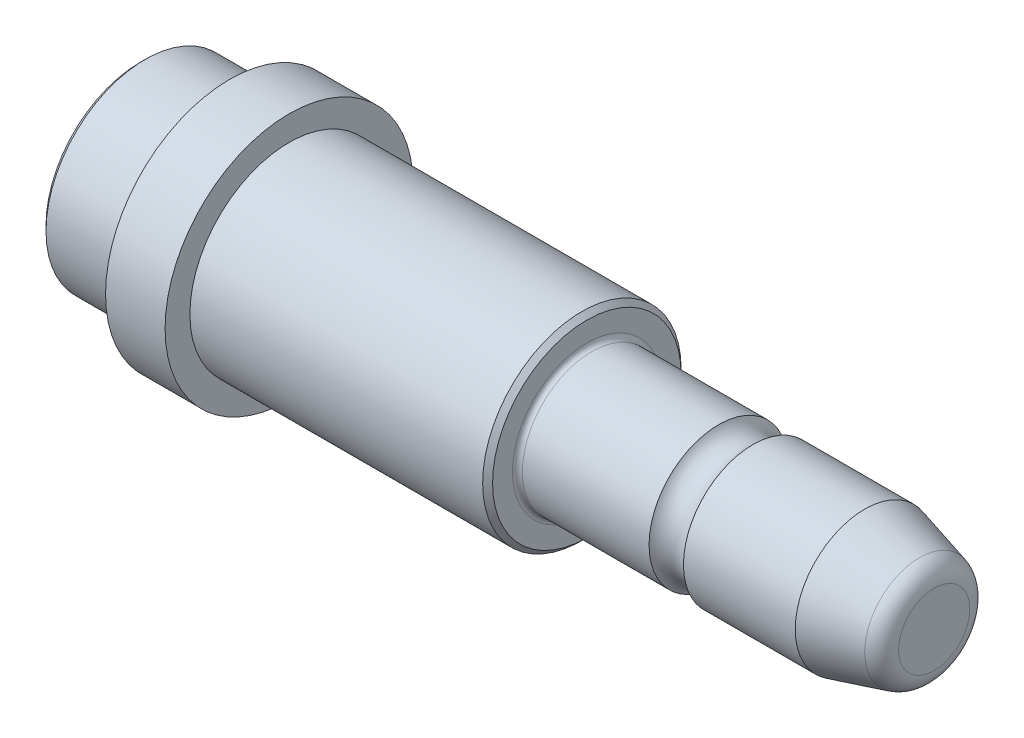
ISO-10303-21;
HEADER;
FILE_DESCRIPTION(('STEP AP214'),'2;1');
FILE_NAME('part.step','',(''),(''),'','','');
FILE_SCHEMA(('AUTOMOTIVE_DESIGN { 1 0 10303 214 1 1 1 1 }'));
ENDSEC;
DATA;
#1=APPLICATION_CONTEXT('core data for automotive mechanical design processes');
#2=APPLICATION_PROTOCOL_DEFINITION('international standard','automotive_design',2000,#1);
#3=PRODUCT_CONTEXT('',#1,'mechanical');
#4=PRODUCT('Part','Part','',(#3));
#5=PRODUCT_RELATED_PRODUCT_CATEGORY('part','',(#4));
#6=PRODUCT_DEFINITION_FORMATION('','',#4);
#7=PRODUCT_DEFINITION_CONTEXT('part definition',#1,'design');
#8=PRODUCT_DEFINITION('design','',#6,#7);
#9=PRODUCT_DEFINITION_SHAPE('','',#8);
#10=(LENGTH_UNIT() NAMED_UNIT(*) SI_UNIT(.MILLI.,.METRE.));
#11=(NAMED_UNIT(*) PLANE_ANGLE_UNIT() SI_UNIT($,.RADIAN.));
#12=(NAMED_UNIT(*) SI_UNIT($,.STERADIAN.) SOLID_ANGLE_UNIT());
#13=UNCERTAINTY_MEASURE_WITH_UNIT(LENGTH_MEASURE(1.E-05),#10,'distance_accuracy_value','');
#14=(GEOMETRIC_REPRESENTATION_CONTEXT(3) GLOBAL_UNCERTAINTY_ASSIGNED_CONTEXT((#13)) GLOBAL_UNIT_ASSIGNED_CONTEXT((#10,
#11,#12)) REPRESENTATION_CONTEXT('',''));
#15=CARTESIAN_POINT('',(0.,0.,0.));
#16=DIRECTION('',(0.,0.,1.));
#17=DIRECTION('',(1.,0.,0.));
#18=AXIS2_PLACEMENT_3D('',#15,#16,#17);
#19=CARTESIAN_POINT('',(9.,12.5,0.));
#20=DIRECTION('',(1.,0.,0.));
#21=DIRECTION('',(0.,0.,-1.));
#22=AXIS2_PLACEMENT_3D('',#19,#20,#21);
#23=PLANE('',#22);
#24=CARTESIAN_POINT('',(9.,0.,0.));
#25=DIRECTION('',(-1.,0.,0.));
#26=DIRECTION('',(0.,0.,1.));
#27=AXIS2_PLACEMENT_3D('',#24,#25,#26);
#28=CIRCLE('',#27,10.);
#29=CARTESIAN_POINT('',(9.,0.,10.));
#30=VERTEX_POINT('',#29);
#31=EDGE_CURVE('E61',#30,#30,#28,.T.);
#32=ORIENTED_EDGE('',*,*,#31,.F.);
#33=EDGE_LOOP('',(#32));
#34=FACE_BOUND('',#33,.T.);
#35=CARTESIAN_POINT('',(9.,0.,0.));
#36=DIRECTION('',(-1.,0.,0.));
#37=DIRECTION('',(0.,0.,1.));
#38=AXIS2_PLACEMENT_3D('',#35,#36,#37);
#39=CIRCLE('',#38,12.5);
#40=CARTESIAN_POINT('',(9.,0.,12.5));
#41=VERTEX_POINT('',#40);
#42=EDGE_CURVE('E79',#41,#41,#39,.T.);
#43=ORIENTED_EDGE('',*,*,#42,.T.);
#44=EDGE_LOOP('',(#43));
#45=FACE_BOUND('',#44,.T.);
#46=ADVANCED_FACE('F30',(#34,#45),#23,.F.);
#47=CARTESIAN_POINT('',(-12.992566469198,0.,0.));
#48=DIRECTION('',(-1.,0.,0.));
#49=DIRECTION('',(0.,0.,1.));
#50=AXIS2_PLACEMENT_3D('',#47,#48,#49);
#51=CYLINDRICAL_SURFACE('',#50,10.);
#52=CARTESIAN_POINT('',(0.500000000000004,0.,0.));
#53=DIRECTION('',(1.,0.,0.));
#54=DIRECTION('',(0.,0.,-1.));
#55=AXIS2_PLACEMENT_3D('',#52,#53,#54);
#56=CIRCLE('',#55,10.);
#57=CARTESIAN_POINT('',(0.500000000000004,0.,-10.));
#58=VERTEX_POINT('',#57);
#59=EDGE_CURVE('E49',#58,#58,#56,.T.);
#60=ORIENTED_EDGE('',*,*,#59,.T.);
#61=EDGE_LOOP('',(#60));
#62=FACE_BOUND('',#61,.T.);
#63=ORIENTED_EDGE('',*,*,#31,.T.);
#64=EDGE_LOOP('',(#63));
#65=FACE_BOUND('',#64,.T.);
#66=ADVANCED_FACE('F109',(#62,#65),#51,.T.);
#67=CARTESIAN_POINT('',(0.,10.,0.));
#68=DIRECTION('',(1.,0.,0.));
#69=DIRECTION('',(0.,0.,-1.));
#70=AXIS2_PLACEMENT_3D('',#67,#68,#69);
#71=PLANE('',#70);
#72=CARTESIAN_POINT('',(0.,0.,0.));
#73=DIRECTION('',(1.,0.,0.));
#74=DIRECTION('',(0.,0.,-1.));
#75=AXIS2_PLACEMENT_3D('',#72,#73,#74);
#76=CIRCLE('',#75,9.5);
#77=CARTESIAN_POINT('',(0.,0.,-9.5));
#78=VERTEX_POINT('',#77);
#79=EDGE_CURVE('E52',#78,#78,#76,.F.);
#80=ORIENTED_EDGE('',*,*,#79,.T.);
#81=EDGE_LOOP('',(#80));
#82=FACE_BOUND('',#81,.T.);
#83=ADVANCED_FACE('F114',(#82),#71,.F.);
#84=CARTESIAN_POINT('',(80.,5.12435565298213,0.));
#85=DIRECTION('',(-1.,0.,0.));
#86=DIRECTION('',(0.,0.,1.));
#87=AXIS2_PLACEMENT_3D('',#84,#85,#86);
#88=PLANE('',#87);
#89=CARTESIAN_POINT('',(80.,0.,0.));
#90=DIRECTION('',(-1.,0.,0.));
#91=DIRECTION('',(0.,0.,1.));
#92=AXIS2_PLACEMENT_3D('',#89,#90,#91);
#93=CIRCLE('',#92,3.58970167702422);
#94=CARTESIAN_POINT('',(80.,0.,3.58970167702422));
#95=VERTEX_POINT('',#94);
#96=EDGE_CURVE('E10',#95,#95,#93,.F.);
#97=ORIENTED_EDGE('',*,*,#96,.T.);
#98=EDGE_LOOP('',(#97));
#99=FACE_BOUND('',#98,.T.);
#100=ADVANCED_FACE('F121',(#99),#88,.F.);
#101=CARTESIAN_POINT('',(80.,0.,0.));
#102=DIRECTION('',(-1.,0.,0.));
#103=DIRECTION('',(0.,0.,1.));
#104=AXIS2_PLACEMENT_3D('',#101,#102,#103);
#105=CONICAL_SURFACE('',#104,5.12435565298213,0.26179938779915);
#106=CARTESIAN_POINT('',(78.517638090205,0.,0.));
#107=DIRECTION('',(1.,0.,0.));
#108=DIRECTION('',(0.,0.,-1.));
#109=AXIS2_PLACEMENT_3D('',#106,#107,#108);
#110=CIRCLE('',#109,5.52155332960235);
#111=CARTESIAN_POINT('',(78.517638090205,0.,-5.52155332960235));
#112=VERTEX_POINT('',#111);
#113=EDGE_CURVE('E36',#112,#112,#110,.F.);
#114=ORIENTED_EDGE('',*,*,#113,.T.);
#115=EDGE_LOOP('',(#114));
#116=FACE_BOUND('',#115,.T.);
#117=CARTESIAN_POINT('',(73.,0.,0.));
#118=DIRECTION('',(-1.,0.,0.));
#119=DIRECTION('',(0.,0.,1.));
#120=AXIS2_PLACEMENT_3D('',#117,#118,#119);
#121=CIRCLE('',#120,7.);
#122=CARTESIAN_POINT('',(73.,0.,7.));
#123=VERTEX_POINT('',#122);
#124=EDGE_CURVE('E64',#123,#123,#121,.T.);
#125=ORIENTED_EDGE('',*,*,#124,.F.);
#126=EDGE_LOOP('',(#125));
#127=FACE_BOUND('',#126,.T.);
#128=ADVANCED_FACE('F127',(#116,#127),#105,.T.);
#129=CARTESIAN_POINT('',(-12.992566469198,0.,0.));
#130=DIRECTION('',(-1.,0.,0.));
#131=DIRECTION('',(0.,0.,1.));
#132=AXIS2_PLACEMENT_3D('',#129,#130,#131);
#133=CYLINDRICAL_SURFACE('',#132,7.);
#134=CARTESIAN_POINT('',(61.7320508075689,0.,0.));
#135=DIRECTION('',(-1.,0.,0.));
#136=DIRECTION('',(0.,0.,1.));
#137=AXIS2_PLACEMENT_3D('',#134,#135,#136);
#138=CIRCLE('',#137,7.);
#139=CARTESIAN_POINT('',(61.7320508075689,0.,7.));
#140=VERTEX_POINT('',#139);
#141=EDGE_CURVE('E67',#140,#140,#138,.T.);
#142=ORIENTED_EDGE('',*,*,#141,.F.);
#143=EDGE_LOOP('',(#142));
#144=FACE_BOUND('',#143,.T.);
#145=ORIENTED_EDGE('',*,*,#124,.T.);
#146=EDGE_LOOP('',(#145));
#147=FACE_BOUND('',#146,.T.);
#148=ADVANCED_FACE('F130',(#144,#147),#133,.T.);
#149=CARTESIAN_POINT('',(60.,0.,0.));
#150=DIRECTION('',(-1.,0.,0.));
#151=DIRECTION('',(0.,0.,1.));
#152=AXIS2_PLACEMENT_3D('',#149,#150,#151);
#153=TOROIDAL_SURFACE('',#152,8.,2.);
#154=CARTESIAN_POINT('',(58.2679491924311,0.,0.));
#155=DIRECTION('',(-1.,0.,0.));
#156=DIRECTION('',(0.,0.,1.));
#157=AXIS2_PLACEMENT_3D('',#154,#155,#156);
#158=CIRCLE('',#157,7.);
#159=CARTESIAN_POINT('',(58.2679491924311,0.,7.));
#160=VERTEX_POINT('',#159);
#161=EDGE_CURVE('E70',#160,#160,#158,.T.);
#162=ORIENTED_EDGE('',*,*,#161,.F.);
#163=EDGE_LOOP('',(#162));
#164=FACE_BOUND('',#163,.T.);
#165=ORIENTED_EDGE('',*,*,#141,.T.);
#166=EDGE_LOOP('',(#165));
#167=FACE_BOUND('',#166,.T.);
#168=ADVANCED_FACE('F133',(#164,#167),#153,.F.);
#169=CARTESIAN_POINT('',(-12.992566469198,0.,0.));
#170=DIRECTION('',(-1.,0.,0.));
#171=DIRECTION('',(0.,0.,1.));
#172=AXIS2_PLACEMENT_3D('',#169,#170,#171);
#173=CYLINDRICAL_SURFACE('',#172,7.);
#174=CARTESIAN_POINT('',(45.5,0.,0.));
#175=DIRECTION('',(-1.,0.,0.));
#176=DIRECTION('',(0.,0.,1.));
#177=AXIS2_PLACEMENT_3D('',#174,#175,#176);
#178=CIRCLE('',#177,7.);
#179=CARTESIAN_POINT('',(45.5,0.,7.));
#180=VERTEX_POINT('',#179);
#181=EDGE_CURVE('E40',#180,#180,#178,.F.);
#182=ORIENTED_EDGE('',*,*,#181,.T.);
#183=EDGE_LOOP('',(#182));
#184=FACE_BOUND('',#183,.T.);
#185=ORIENTED_EDGE('',*,*,#161,.T.);
#186=EDGE_LOOP('',(#185));
#187=FACE_BOUND('',#186,.T.);
#188=ADVANCED_FACE('F105',(#184,#187),#173,.T.);
#189=CARTESIAN_POINT('',(45.,10.,0.));
#190=DIRECTION('',(-1.,0.,0.));
#191=DIRECTION('',(0.,0.,1.));
#192=AXIS2_PLACEMENT_3D('',#189,#190,#191);
#193=PLANE('',#192);
#194=CARTESIAN_POINT('',(45.,0.,0.));
#195=DIRECTION('',(-1.,0.,0.));
#196=DIRECTION('',(0.,0.,1.));
#197=AXIS2_PLACEMENT_3D('',#194,#195,#196);
#198=CIRCLE('',#197,7.5);
#199=CARTESIAN_POINT('',(45.,0.,7.5));
#200=VERTEX_POINT('',#199);
#201=EDGE_CURVE('E44',#200,#200,#198,.T.);
#202=ORIENTED_EDGE('',*,*,#201,.T.);
#203=EDGE_LOOP('',(#202));
#204=FACE_BOUND('',#203,.T.);
#205=CARTESIAN_POINT('',(45.,0.,0.));
#206=DIRECTION('',(-1.,0.,0.));
#207=DIRECTION('',(0.,0.,1.));
#208=AXIS2_PLACEMENT_3D('',#205,#206,#207);
#209=CIRCLE('',#208,9.49999999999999);
#210=CARTESIAN_POINT('',(45.,0.,9.49999999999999));
#211=VERTEX_POINT('',#210);
#212=EDGE_CURVE('E55',#211,#211,#209,.F.);
#213=ORIENTED_EDGE('',*,*,#212,.T.);
#214=EDGE_LOOP('',(#213));
#215=FACE_BOUND('',#214,.T.);
#216=ADVANCED_FACE('F99',(#204,#215),#193,.F.);
#217=CARTESIAN_POINT('',(-12.992566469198,0.,0.));
#218=DIRECTION('',(-1.,0.,0.));
#219=DIRECTION('',(0.,0.,1.));
#220=AXIS2_PLACEMENT_3D('',#217,#218,#219);
#221=CYLINDRICAL_SURFACE('',#220,10.);
#222=CARTESIAN_POINT('',(44.5,0.,0.));
#223=DIRECTION('',(-1.,0.,0.));
#224=DIRECTION('',(0.,0.,1.));
#225=AXIS2_PLACEMENT_3D('',#222,#223,#224);
#226=CIRCLE('',#225,10.);
#227=CARTESIAN_POINT('',(44.5,0.,10.));
#228=VERTEX_POINT('',#227);
#229=EDGE_CURVE('E58',#228,#228,#226,.T.);
#230=ORIENTED_EDGE('',*,*,#229,.T.);
#231=EDGE_LOOP('',(#230));
#232=FACE_BOUND('',#231,.T.);
#233=CARTESIAN_POINT('',(15.,0.,0.));
#234=DIRECTION('',(-1.,0.,0.));
#235=DIRECTION('',(0.,0.,1.));
#236=AXIS2_PLACEMENT_3D('',#233,#234,#235);
#237=CIRCLE('',#236,10.);
#238=CARTESIAN_POINT('',(15.,0.,10.));
#239=VERTEX_POINT('',#238);
#240=EDGE_CURVE('E73',#239,#239,#237,.T.);
#241=ORIENTED_EDGE('',*,*,#240,.F.);
#242=EDGE_LOOP('',(#241));
#243=FACE_BOUND('',#242,.T.);
#244=ADVANCED_FACE('F94',(#232,#243),#221,.T.);
#245=CARTESIAN_POINT('',(15.,12.5,0.));
#246=DIRECTION('',(-1.,0.,0.));
#247=DIRECTION('',(0.,0.,1.));
#248=AXIS2_PLACEMENT_3D('',#245,#246,#247);
#249=PLANE('',#248);
#250=CARTESIAN_POINT('',(15.,0.,0.));
#251=DIRECTION('',(-1.,0.,0.));
#252=DIRECTION('',(0.,0.,1.));
#253=AXIS2_PLACEMENT_3D('',#250,#251,#252);
#254=CIRCLE('',#253,12.5);
#255=CARTESIAN_POINT('',(15.,0.,12.5));
#256=VERTEX_POINT('',#255);
#257=EDGE_CURVE('E76',#256,#256,#254,.T.);
#258=ORIENTED_EDGE('',*,*,#257,.F.);
#259=EDGE_LOOP('',(#258));
#260=FACE_BOUND('',#259,.T.);
#261=ORIENTED_EDGE('',*,*,#240,.T.);
#262=EDGE_LOOP('',(#261));
#263=FACE_BOUND('',#262,.T.);
#264=ADVANCED_FACE('F88',(#260,#263),#249,.F.);
#265=CARTESIAN_POINT('',(-12.992566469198,0.,0.));
#266=DIRECTION('',(-1.,0.,0.));
#267=DIRECTION('',(0.,0.,1.));
#268=AXIS2_PLACEMENT_3D('',#265,#266,#267);
#269=CYLINDRICAL_SURFACE('',#268,12.5);
#270=ORIENTED_EDGE('',*,*,#42,.F.);
#271=EDGE_LOOP('',(#270));
#272=FACE_BOUND('',#271,.T.);
#273=ORIENTED_EDGE('',*,*,#257,.T.);
#274=EDGE_LOOP('',(#273));
#275=FACE_BOUND('',#274,.T.);
#276=ADVANCED_FACE('F84',(#272,#275),#269,.T.);
#277=CARTESIAN_POINT('',(44.5,0.,0.));
#278=DIRECTION('',(-1.,0.,0.));
#279=DIRECTION('',(0.,0.,1.));
#280=AXIS2_PLACEMENT_3D('',#277,#278,#279);
#281=CONICAL_SURFACE('',#280,10.,0.785398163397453);
#282=ORIENTED_EDGE('',*,*,#212,.F.);
#283=EDGE_LOOP('',(#282));
#284=FACE_BOUND('',#283,.T.);
#285=ORIENTED_EDGE('',*,*,#229,.F.);
#286=EDGE_LOOP('',(#285));
#287=FACE_BOUND('',#286,.T.);
#288=ADVANCED_FACE('F87',(#284,#287),#281,.T.);
#289=CARTESIAN_POINT('',(0.,0.,0.));
#290=DIRECTION('',(1.,0.,0.));
#291=DIRECTION('',(0.,0.,-1.));
#292=AXIS2_PLACEMENT_3D('',#289,#290,#291);
#293=CONICAL_SURFACE('',#292,9.5,0.785398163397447);
#294=ORIENTED_EDGE('',*,*,#59,.F.);
#295=EDGE_LOOP('',(#294));
#296=FACE_BOUND('',#295,.T.);
#297=ORIENTED_EDGE('',*,*,#79,.F.);
#298=EDGE_LOOP('',(#297));
#299=FACE_BOUND('',#298,.T.);
#300=ADVANCED_FACE('F155',(#296,#299),#293,.T.);
#301=CARTESIAN_POINT('',(45.5,0.,0.));
#302=DIRECTION('',(-1.,0.,0.));
#303=DIRECTION('',(0.,0.,1.));
#304=AXIS2_PLACEMENT_3D('',#301,#302,#303);
#305=TOROIDAL_SURFACE('',#304,7.5,0.5);
#306=ORIENTED_EDGE('',*,*,#181,.F.);
#307=EDGE_LOOP('',(#306));
#308=FACE_BOUND('',#307,.T.);
#309=ORIENTED_EDGE('',*,*,#201,.F.);
#310=EDGE_LOOP('',(#309));
#311=FACE_BOUND('',#310,.T.);
#312=ADVANCED_FACE('F151',(#308,#311),#305,.F.);
#313=CARTESIAN_POINT('',(78.,0.,0.));
#314=DIRECTION('',(-1.,0.,0.));
#315=DIRECTION('',(0.,0.,1.));
#316=AXIS2_PLACEMENT_3D('',#313,#314,#315);
#317=TOROIDAL_SURFACE('',#316,3.58970167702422,2.);
#318=ORIENTED_EDGE('',*,*,#96,.F.);
#319=EDGE_LOOP('',(#318));
#320=FACE_BOUND('',#319,.T.);
#321=ORIENTED_EDGE('',*,*,#113,.F.);
#322=EDGE_LOOP('',(#321));
#323=FACE_BOUND('',#322,.T.);
#324=ADVANCED_FACE('F154',(#320,#323),#317,.T.);
#325=CLOSED_SHELL('',(#46,#66,#83,#100,#128,#148,#168,#188,#216,#244,#264,#276,#288,#300,#312,#324));
#326=MANIFOLD_SOLID_BREP('B2',#325);
#327=ADVANCED_BREP_SHAPE_REPRESENTATION('',(#18,#326),#14);
#328=SHAPE_DEFINITION_REPRESENTATION(#9,#327);
ENDSEC;
END-ISO-10303-21;
